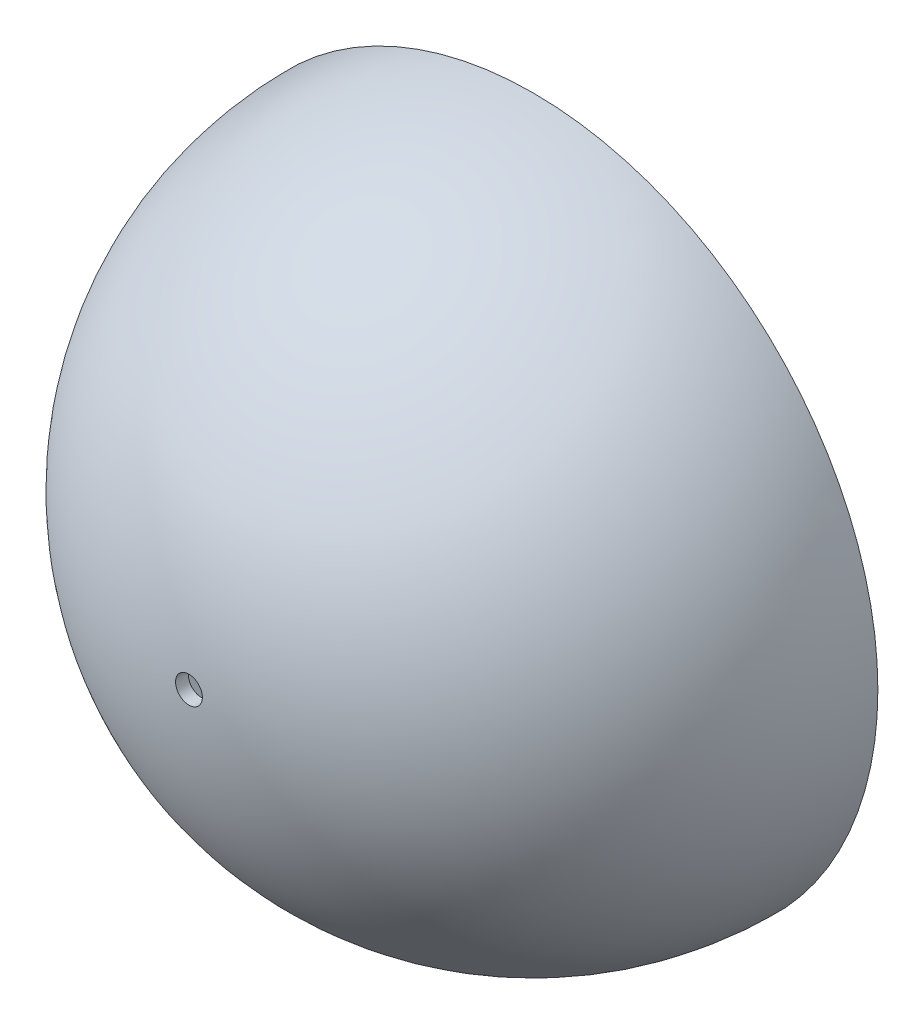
from build123d import *

# Parameters (mm, degrees)
REVOLVE1_ANGLE = 180
SHELL1_T       = -2
SKETCH2_R      = 2.1
EXTRUDE1_DEPTH = 94.530743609


with BuildPart() as part:
    # Sketch1 → Revolve1 (revolve)
    with BuildSketch(Plane.XY):
        with BuildLine():
            Line((-54, 0), (54, 0))
            ThreePointArc((54, 0), (0, 54), (-54, 0))
        make_face()
    revolve(axis=Axis((-54, 0, 0), (1, 0, 0)), revolution_arc=REVOLVE1_ANGLE)

    # Shell1
    shell1_openings = [part.faces().sort_by_distance(p)[0] for p in [
        (0, 0, 0),
    ]]
    offset(amount=SHELL1_T, openings=shell1_openings)

    # Sketch2 → Extrude1 (cut, through all)
    with BuildSketch(Plane(origin=(0, 0, 0), x_dir=(-1, 0, 0), z_dir=(0, 0, -1))):
        with Locations(Location((0, 0, 0), (0, 0, 90))):
            Circle(SKETCH2_R)
    extrude(amount=-EXTRUDE1_DEPTH, mode=Mode.SUBTRACT)


solid = part.part
